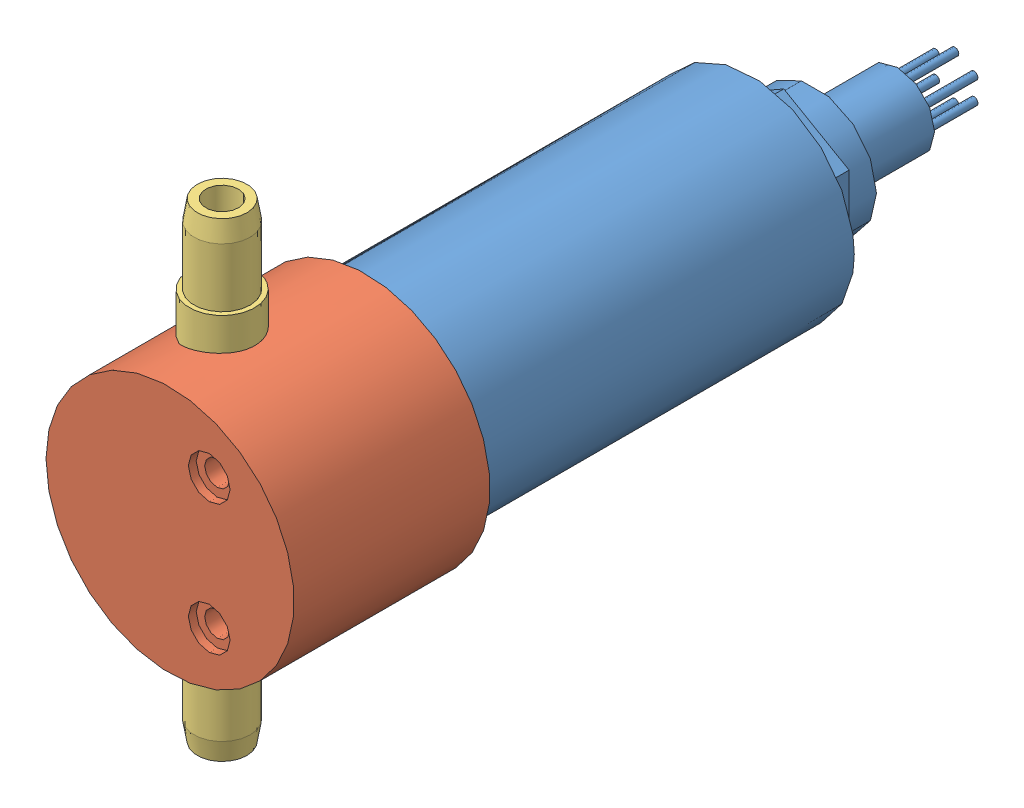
SolidWorks assembly GSO_6605_SCFmini.SLDASM, configuration Default (file format 3800). Lengths in mm.
Overall size (48.26 91.44 152.65).
5 component instances, 3 part files, 3 mates.
Components (placement in the parent):
- GSO_6610_SCFmini-1: GSO_6610_SCFmini.SLDPRT [Default] at origin size (40.13 40.13 145.54)
- GSO_6617_SCFmini_cap_assmbly-1: GSO_6617_SCFmini_cap_assmbly.SLDASM [Default] at (7.1786 -11.5505 101.3947) x (-1 0 0) z (0 0 -1) size (48.26 91.44 38.1)
  - GSO_6616_SCFmini_cap_mod-1: GSO_6616_SCFmini_cap_mod.SLDPRT [Default] at (7.1786 11.5505 -11.6353) size (48.26 48.26 38.1)
  - GSO_6618_hose_barb-1: GSO_6618_hose_barb.SLDPRT [Default] at (12.289 31.8705 3.6047) x (-0.394161 0 0.919041) z (0 1 0) size (12.7 12.7 25.4)
  - GSO_6618_hose_barb-2: GSO_6618_hose_barb.SLDPRT [Default] at (12.289 -8.7695 3.6047) x (1 0 0) z (0 -1 0) size (12.7 12.7 25.4)
Mates (geometry in assembly coordinates):
- Coincident1: coincident anti-aligned: plane of GSO_6610_SCFmini-1 through (0 0 105.918) normal (0 0 1); plane of GSO_6617_SCFmini_cap_assmbly-1/GSO_6616_SCFmini_cap_mod-1 through (0 0 105.918) normal (0 0 -1)
- Concentric1: concentric aligned: cylinder of GSO_6610_SCFmini-1; cylinder of GSO_6617_SCFmini_cap_assmbly-1/GSO_6616_SCFmini_cap_mod-1
- Concentric2: concentric aligned: cylinder of GSO_6610_SCFmini-1; cylinder of GSO_6617_SCFmini_cap_assmbly-1/GSO_6616_SCFmini_cap_mod-1
